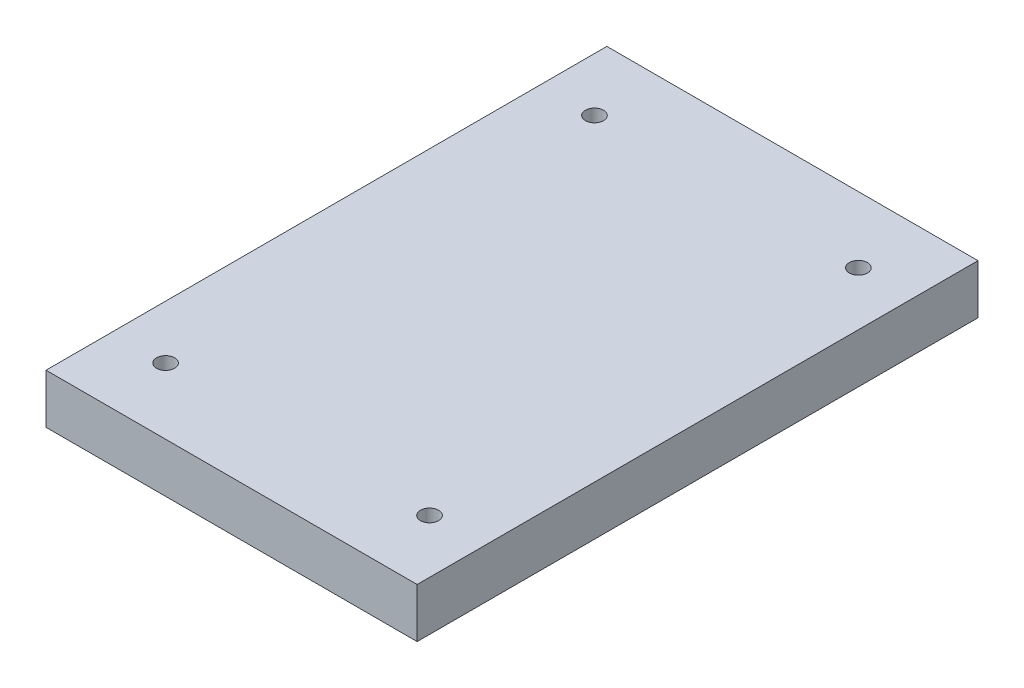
from build123d import *

# Parameters (mm, degrees)
ESQUISSE1_W        = 45
ESQUISSE1_H        = 68
ESQUISSE1_R        = 1.1
BOSS_EXTRU_1_DEPTH = 6


with BuildPart() as part:
    # Esquisse1 → Boss.-Extru.1 (new body)
    with BuildSketch(Plane(origin=(0, 0, 0), x_dir=(1, 0, 0), z_dir=(0, 1, 0))):
        with Locations((20, 37)):
            Rectangle(ESQUISSE1_W, ESQUISSE1_H)
        with Locations(Location((4, 63, 0), (0, 0, 270))):
            Circle(ESQUISSE1_R, mode=Mode.SUBTRACT)
        with Locations(Location((36, 63, 0), (0, 0, 90))):
            Circle(ESQUISSE1_R, mode=Mode.SUBTRACT)
        with Locations(Location((36, 11, 0), (0, 0, 270))):
            Circle(ESQUISSE1_R, mode=Mode.SUBTRACT)
        with Locations(Location((4, 11, 0), (0, 0, 90))):
            Circle(ESQUISSE1_R, mode=Mode.SUBTRACT)
    extrude(amount=BOSS_EXTRU_1_DEPTH)


solid = part.part
